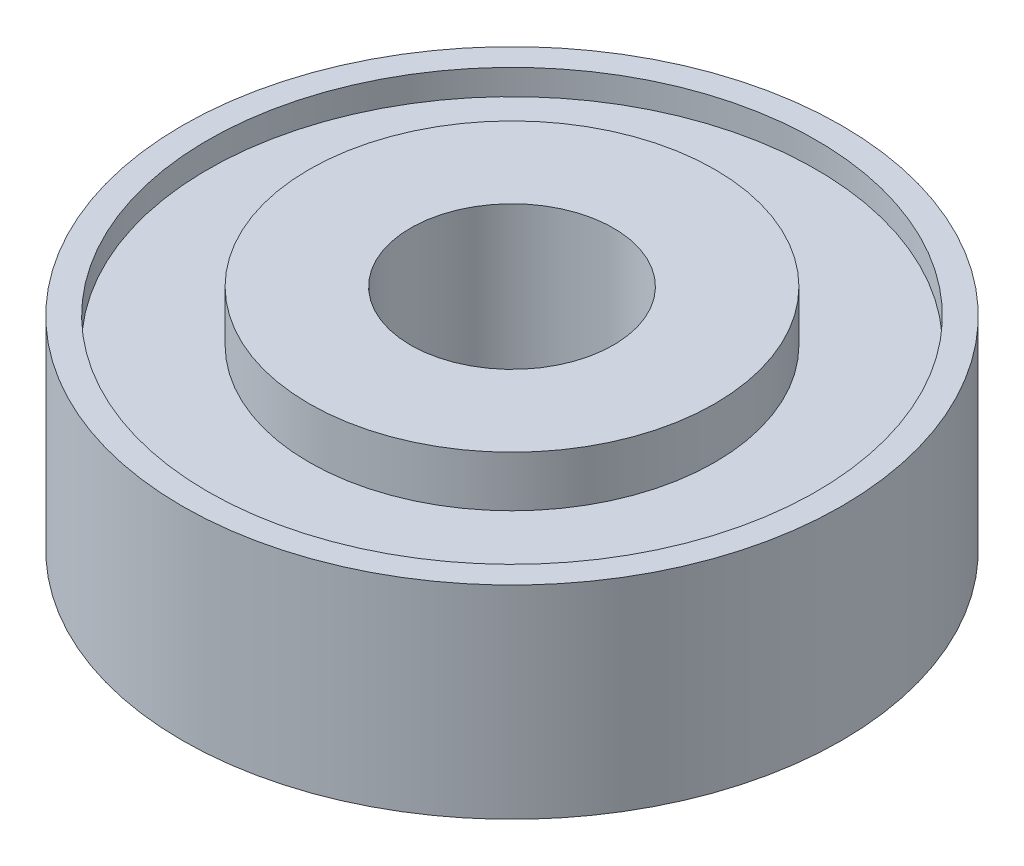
ISO-10303-21;
HEADER;
FILE_DESCRIPTION(('STEP AP214'),'2;1');
FILE_NAME('part.step','',(''),(''),'','','');
FILE_SCHEMA(('AUTOMOTIVE_DESIGN { 1 0 10303 214 1 1 1 1 }'));
ENDSEC;
DATA;
#1=APPLICATION_CONTEXT('core data for automotive mechanical design processes');
#2=APPLICATION_PROTOCOL_DEFINITION('international standard','automotive_design',2000,#1);
#3=PRODUCT_CONTEXT('',#1,'mechanical');
#4=PRODUCT('Part','Part','',(#3));
#5=PRODUCT_RELATED_PRODUCT_CATEGORY('part','',(#4));
#6=PRODUCT_DEFINITION_FORMATION('','',#4);
#7=PRODUCT_DEFINITION_CONTEXT('part definition',#1,'design');
#8=PRODUCT_DEFINITION('design','',#6,#7);
#9=PRODUCT_DEFINITION_SHAPE('','',#8);
#10=(LENGTH_UNIT() NAMED_UNIT(*) SI_UNIT(.MILLI.,.METRE.));
#11=(NAMED_UNIT(*) PLANE_ANGLE_UNIT() SI_UNIT($,.RADIAN.));
#12=(NAMED_UNIT(*) SI_UNIT($,.STERADIAN.) SOLID_ANGLE_UNIT());
#13=UNCERTAINTY_MEASURE_WITH_UNIT(LENGTH_MEASURE(1.E-05),#10,'distance_accuracy_value','');
#14=(GEOMETRIC_REPRESENTATION_CONTEXT(3) GLOBAL_UNCERTAINTY_ASSIGNED_CONTEXT((#13)) GLOBAL_UNIT_ASSIGNED_CONTEXT((#10,
#11,#12)) REPRESENTATION_CONTEXT('',''));
#15=CARTESIAN_POINT('',(0.,0.,0.));
#16=DIRECTION('',(0.,0.,1.));
#17=DIRECTION('',(1.,0.,0.));
#18=AXIS2_PLACEMENT_3D('',#15,#16,#17);
#19=CARTESIAN_POINT('',(0.,0.,0.));
#20=DIRECTION('',(0.,1.,0.));
#21=DIRECTION('',(0.,0.,1.));
#22=AXIS2_PLACEMENT_3D('',#19,#20,#21);
#23=PLANE('',#22);
#24=CARTESIAN_POINT('',(0.,0.,0.));
#25=DIRECTION('',(0.,1.,0.));
#26=DIRECTION('',(0.,0.,1.));
#27=AXIS2_PLACEMENT_3D('',#24,#25,#26);
#28=CIRCLE('',#27,2.);
#29=CARTESIAN_POINT('',(0.,0.,2.));
#30=VERTEX_POINT('',#29);
#31=EDGE_CURVE('E65',#30,#30,#28,.T.);
#32=ORIENTED_EDGE('',*,*,#31,.T.);
#33=EDGE_LOOP('',(#32));
#34=FACE_BOUND('',#33,.T.);
#35=CARTESIAN_POINT('',(0.,0.,0.));
#36=DIRECTION('',(0.,-1.,0.));
#37=DIRECTION('',(0.,0.,-1.));
#38=AXIS2_PLACEMENT_3D('',#35,#36,#37);
#39=CIRCLE('',#38,4.);
#40=CARTESIAN_POINT('',(0.,0.,-4.));
#41=VERTEX_POINT('',#40);
#42=EDGE_CURVE('E132',#41,#41,#39,.T.);
#43=ORIENTED_EDGE('',*,*,#42,.T.);
#44=EDGE_LOOP('',(#43));
#45=FACE_BOUND('',#44,.T.);
#46=ADVANCED_FACE('F42',(#34,#45),#23,.F.);
#47=CARTESIAN_POINT('',(0.,5.,0.));
#48=DIRECTION('',(0.,1.,0.));
#49=DIRECTION('',(0.,0.,1.));
#50=AXIS2_PLACEMENT_3D('',#47,#48,#49);
#51=PLANE('',#50);
#52=CARTESIAN_POINT('',(0.,5.,0.));
#53=DIRECTION('',(0.,1.,0.));
#54=DIRECTION('',(0.,0.,1.));
#55=AXIS2_PLACEMENT_3D('',#52,#53,#54);
#56=CIRCLE('',#55,2.);
#57=CARTESIAN_POINT('',(0.,5.,2.));
#58=VERTEX_POINT('',#57);
#59=EDGE_CURVE('E57',#58,#58,#56,.T.);
#60=ORIENTED_EDGE('',*,*,#59,.F.);
#61=EDGE_LOOP('',(#60));
#62=FACE_BOUND('',#61,.T.);
#63=CARTESIAN_POINT('',(0.,5.,0.));
#64=DIRECTION('',(0.,1.,0.));
#65=DIRECTION('',(0.,0.,1.));
#66=AXIS2_PLACEMENT_3D('',#63,#64,#65);
#67=CIRCLE('',#66,4.);
#68=CARTESIAN_POINT('',(0.,5.,4.));
#69=VERTEX_POINT('',#68);
#70=EDGE_CURVE('E81',#69,#69,#67,.T.);
#71=ORIENTED_EDGE('',*,*,#70,.T.);
#72=EDGE_LOOP('',(#71));
#73=FACE_BOUND('',#72,.T.);
#74=ADVANCED_FACE('F113',(#62,#73),#51,.T.);
#75=CARTESIAN_POINT('',(0.,4.5,0.));
#76=DIRECTION('',(0.,1.,0.));
#77=DIRECTION('',(0.,0.,1.));
#78=AXIS2_PLACEMENT_3D('',#75,#76,#77);
#79=PLANE('',#78);
#80=CARTESIAN_POINT('',(0.,4.5,0.));
#81=DIRECTION('',(0.,1.,0.));
#82=DIRECTION('',(0.,0.,1.));
#83=AXIS2_PLACEMENT_3D('',#80,#81,#82);
#84=CIRCLE('',#83,6.);
#85=CARTESIAN_POINT('',(0.,4.5,6.));
#86=VERTEX_POINT('',#85);
#87=EDGE_CURVE('E70',#86,#86,#84,.T.);
#88=ORIENTED_EDGE('',*,*,#87,.F.);
#89=EDGE_LOOP('',(#88));
#90=FACE_BOUND('',#89,.T.);
#91=CARTESIAN_POINT('',(0.,4.5,0.));
#92=DIRECTION('',(0.,1.,0.));
#93=DIRECTION('',(0.,0.,1.));
#94=AXIS2_PLACEMENT_3D('',#91,#92,#93);
#95=CIRCLE('',#94,6.5);
#96=CARTESIAN_POINT('',(0.,4.5,6.5));
#97=VERTEX_POINT('',#96);
#98=EDGE_CURVE('E11',#97,#97,#95,.T.);
#99=ORIENTED_EDGE('',*,*,#98,.T.);
#100=EDGE_LOOP('',(#99));
#101=FACE_BOUND('',#100,.T.);
#102=ADVANCED_FACE('F44',(#90,#101),#79,.T.);
#103=CARTESIAN_POINT('',(0.,0.5,0.));
#104=DIRECTION('',(0.,1.,0.));
#105=DIRECTION('',(0.,0.,1.));
#106=AXIS2_PLACEMENT_3D('',#103,#104,#105);
#107=PLANE('',#106);
#108=CARTESIAN_POINT('',(0.,0.5,0.));
#109=DIRECTION('',(0.,1.,0.));
#110=DIRECTION('',(0.,0.,1.));
#111=AXIS2_PLACEMENT_3D('',#108,#109,#110);
#112=CIRCLE('',#111,6.);
#113=CARTESIAN_POINT('',(0.,0.5,6.));
#114=VERTEX_POINT('',#113);
#115=EDGE_CURVE('E68',#114,#114,#112,.F.);
#116=ORIENTED_EDGE('',*,*,#115,.F.);
#117=EDGE_LOOP('',(#116));
#118=FACE_BOUND('',#117,.T.);
#119=CARTESIAN_POINT('',(0.,0.5,0.));
#120=DIRECTION('',(0.,1.,0.));
#121=DIRECTION('',(0.,0.,1.));
#122=AXIS2_PLACEMENT_3D('',#119,#120,#121);
#123=CIRCLE('',#122,6.5);
#124=CARTESIAN_POINT('',(0.,0.5,6.5));
#125=VERTEX_POINT('',#124);
#126=EDGE_CURVE('E50',#125,#125,#123,.T.);
#127=ORIENTED_EDGE('',*,*,#126,.F.);
#128=EDGE_LOOP('',(#127));
#129=FACE_BOUND('',#128,.T.);
#130=ADVANCED_FACE('F108',(#118,#129),#107,.F.);
#131=CARTESIAN_POINT('',(0.,5.,0.));
#132=DIRECTION('',(0.,-1.,0.));
#133=DIRECTION('',(0.,0.,-1.));
#134=AXIS2_PLACEMENT_3D('',#131,#132,#133);
#135=CYLINDRICAL_SURFACE('',#134,6.5);
#136=ORIENTED_EDGE('',*,*,#98,.F.);
#137=EDGE_LOOP('',(#136));
#138=FACE_BOUND('',#137,.T.);
#139=ORIENTED_EDGE('',*,*,#126,.T.);
#140=EDGE_LOOP('',(#139));
#141=FACE_BOUND('',#140,.T.);
#142=ADVANCED_FACE('F99',(#138,#141),#135,.T.);
#143=CARTESIAN_POINT('',(0.,5.,0.));
#144=DIRECTION('',(0.,-1.,0.));
#145=DIRECTION('',(0.,0.,-1.));
#146=AXIS2_PLACEMENT_3D('',#143,#144,#145);
#147=CYLINDRICAL_SURFACE('',#146,2.);
#148=ORIENTED_EDGE('',*,*,#59,.T.);
#149=EDGE_LOOP('',(#148));
#150=FACE_BOUND('',#149,.T.);
#151=ORIENTED_EDGE('',*,*,#31,.F.);
#152=EDGE_LOOP('',(#151));
#153=FACE_BOUND('',#152,.T.);
#154=ADVANCED_FACE('F96',(#150,#153),#147,.F.);
#155=CARTESIAN_POINT('',(0.,4.,0.));
#156=DIRECTION('',(0.,1.,0.));
#157=DIRECTION('',(0.,0.,1.));
#158=AXIS2_PLACEMENT_3D('',#155,#156,#157);
#159=CYLINDRICAL_SURFACE('',#158,6.);
#160=CARTESIAN_POINT('',(0.,4.,0.));
#161=DIRECTION('',(0.,1.,0.));
#162=DIRECTION('',(0.,0.,1.));
#163=AXIS2_PLACEMENT_3D('',#160,#161,#162);
#164=CIRCLE('',#163,6.);
#165=CARTESIAN_POINT('',(0.,4.,6.));
#166=VERTEX_POINT('',#165);
#167=EDGE_CURVE('E73',#166,#166,#164,.T.);
#168=ORIENTED_EDGE('',*,*,#167,.F.);
#169=EDGE_LOOP('',(#168));
#170=FACE_BOUND('',#169,.T.);
#171=ORIENTED_EDGE('',*,*,#87,.T.);
#172=EDGE_LOOP('',(#171));
#173=FACE_BOUND('',#172,.T.);
#174=ADVANCED_FACE('F98',(#170,#173),#159,.F.);
#175=CARTESIAN_POINT('',(0.,4.,0.));
#176=DIRECTION('',(0.,1.,0.));
#177=DIRECTION('',(0.,0.,1.));
#178=AXIS2_PLACEMENT_3D('',#175,#176,#177);
#179=PLANE('',#178);
#180=CARTESIAN_POINT('',(0.,4.,0.));
#181=DIRECTION('',(0.,1.,0.));
#182=DIRECTION('',(0.,0.,1.));
#183=AXIS2_PLACEMENT_3D('',#180,#181,#182);
#184=CIRCLE('',#183,4.);
#185=CARTESIAN_POINT('',(0.,4.,4.));
#186=VERTEX_POINT('',#185);
#187=EDGE_CURVE('E74',#186,#186,#184,.T.);
#188=ORIENTED_EDGE('',*,*,#187,.F.);
#189=EDGE_LOOP('',(#188));
#190=FACE_BOUND('',#189,.T.);
#191=ORIENTED_EDGE('',*,*,#167,.T.);
#192=EDGE_LOOP('',(#191));
#193=FACE_BOUND('',#192,.T.);
#194=ADVANCED_FACE('F105',(#190,#193),#179,.T.);
#195=CARTESIAN_POINT('',(0.,4.,0.));
#196=DIRECTION('',(0.,1.,0.));
#197=DIRECTION('',(0.,0.,1.));
#198=AXIS2_PLACEMENT_3D('',#195,#196,#197);
#199=CYLINDRICAL_SURFACE('',#198,4.);
#200=ORIENTED_EDGE('',*,*,#187,.T.);
#201=EDGE_LOOP('',(#200));
#202=FACE_BOUND('',#201,.T.);
#203=ORIENTED_EDGE('',*,*,#70,.F.);
#204=EDGE_LOOP('',(#203));
#205=FACE_BOUND('',#204,.T.);
#206=ADVANCED_FACE('F151',(#202,#205),#199,.T.);
#207=CARTESIAN_POINT('',(0.,1.,0.));
#208=DIRECTION('',(0.,-1.,0.));
#209=DIRECTION('',(0.,0.,-1.));
#210=AXIS2_PLACEMENT_3D('',#207,#208,#209);
#211=CYLINDRICAL_SURFACE('',#210,6.);
#212=CARTESIAN_POINT('',(0.,1.,0.));
#213=DIRECTION('',(0.,-1.,0.));
#214=DIRECTION('',(0.,0.,-1.));
#215=AXIS2_PLACEMENT_3D('',#212,#213,#214);
#216=CIRCLE('',#215,6.);
#217=CARTESIAN_POINT('',(0.,1.,-6.));
#218=VERTEX_POINT('',#217);
#219=EDGE_CURVE('E86',#218,#218,#216,.T.);
#220=ORIENTED_EDGE('',*,*,#219,.F.);
#221=EDGE_LOOP('',(#220));
#222=FACE_BOUND('',#221,.T.);
#223=ORIENTED_EDGE('',*,*,#115,.T.);
#224=EDGE_LOOP('',(#223));
#225=FACE_BOUND('',#224,.T.);
#226=ADVANCED_FACE('F145',(#222,#225),#211,.F.);
#227=CARTESIAN_POINT('',(0.,1.,0.));
#228=DIRECTION('',(0.,-1.,0.));
#229=DIRECTION('',(0.,0.,-1.));
#230=AXIS2_PLACEMENT_3D('',#227,#228,#229);
#231=PLANE('',#230);
#232=CARTESIAN_POINT('',(0.,1.,0.));
#233=DIRECTION('',(0.,-1.,0.));
#234=DIRECTION('',(0.,0.,-1.));
#235=AXIS2_PLACEMENT_3D('',#232,#233,#234);
#236=CIRCLE('',#235,4.);
#237=CARTESIAN_POINT('',(0.,1.,-4.));
#238=VERTEX_POINT('',#237);
#239=EDGE_CURVE('E128',#238,#238,#236,.T.);
#240=ORIENTED_EDGE('',*,*,#239,.F.);
#241=EDGE_LOOP('',(#240));
#242=FACE_BOUND('',#241,.T.);
#243=ORIENTED_EDGE('',*,*,#219,.T.);
#244=EDGE_LOOP('',(#243));
#245=FACE_BOUND('',#244,.T.);
#246=ADVANCED_FACE('F141',(#242,#245),#231,.T.);
#247=CARTESIAN_POINT('',(0.,1.,0.));
#248=DIRECTION('',(0.,-1.,0.));
#249=DIRECTION('',(0.,0.,-1.));
#250=AXIS2_PLACEMENT_3D('',#247,#248,#249);
#251=CYLINDRICAL_SURFACE('',#250,4.);
#252=ORIENTED_EDGE('',*,*,#239,.T.);
#253=EDGE_LOOP('',(#252));
#254=FACE_BOUND('',#253,.T.);
#255=ORIENTED_EDGE('',*,*,#42,.F.);
#256=EDGE_LOOP('',(#255));
#257=FACE_BOUND('',#256,.T.);
#258=ADVANCED_FACE('F139',(#254,#257),#251,.T.);
#259=CLOSED_SHELL('',(#46,#74,#102,#130,#142,#154,#174,#194,#206,#226,#246,#258));
#260=MANIFOLD_SOLID_BREP('B2',#259);
#261=ADVANCED_BREP_SHAPE_REPRESENTATION('',(#18,#260),#14);
#262=SHAPE_DEFINITION_REPRESENTATION(#9,#261);
ENDSEC;
END-ISO-10303-21;
